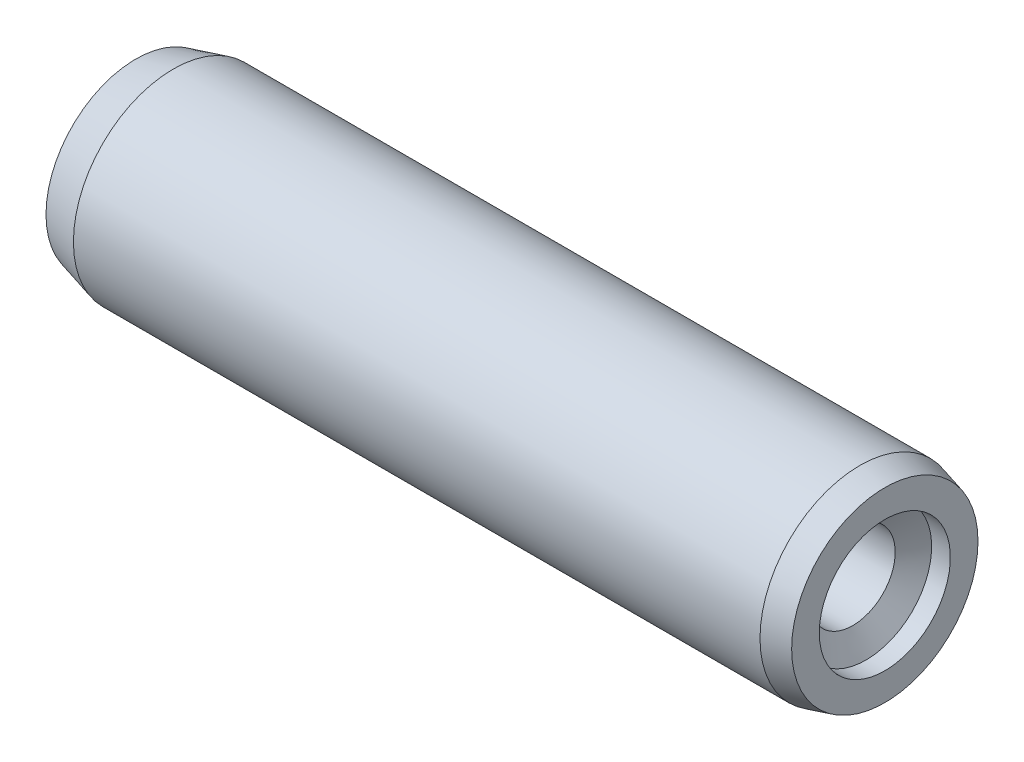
from build123d import *


with BuildPart() as part:
    # BodySke → Body (revolve)
    with BuildSketch(Plane.XY, mode=Mode.PRIVATE) as body_sk:
        Polygon((3, 8), (58, 8), (60, 7.464101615), (60, 5.25), (58.5, 5.25), (57.431902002, 3.4), (35, 3.4), (33.591673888, 0), (0, 0), (0, 7.196152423), align=None)
    revolve(body_sk.sketch.rotate(Axis((0, 0, 0), (1, 0, 0)), 90), axis=Axis((0, 0, 0), (1, 0, 0)))


solid = part.part
